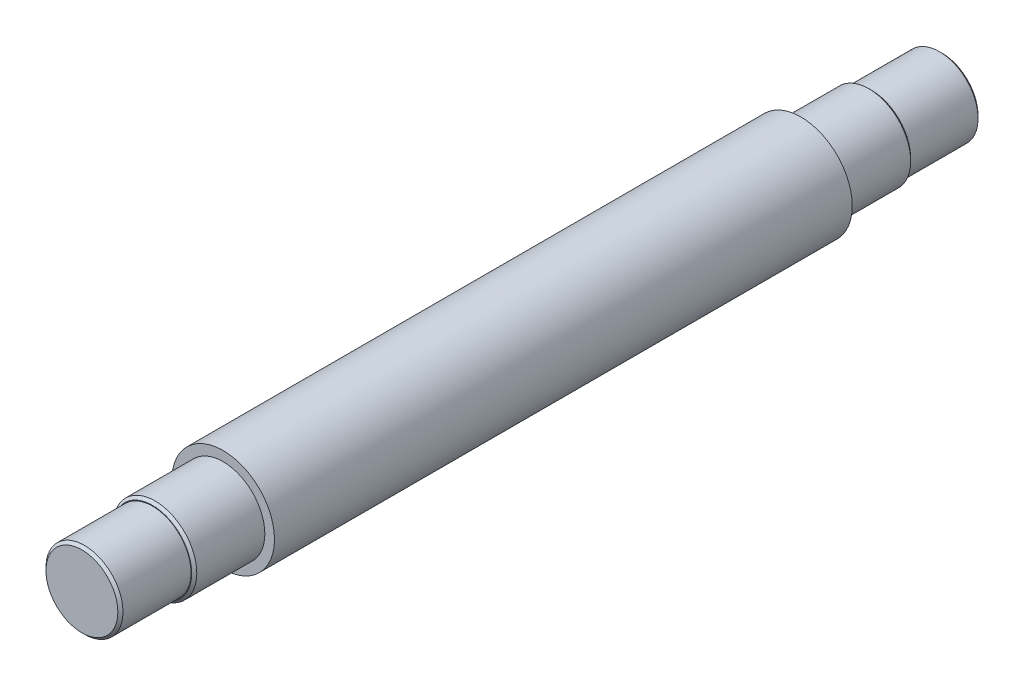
from build123d import *

# Parameters (mm, degrees)
SKETCH_1_R      = 40
EXTRUDE_1_DEPTH = 450
SKETCH_2_R      = 32.5
EXTRUDE_2_DEPTH = 55
EXTRUDE_START   = 55
SKETCH_3_R      = 32.5
EXTRUDE_3_DEPTH = 55
SKETCH_4_R      = 30
EXTRUDE_4_DEPTH = 55
SKETCH_5_R      = 30
EXTRUDE_5_DEPTH = 55
CHAMFER_1_SIZE  = 2
CHAMFER_2_SIZE  = 2


with BuildPart() as part:
    # Sketch 1 → Extrude 1 (new body)
    with BuildSketch(Plane.XY):
        Circle(SKETCH_1_R)
    extrude(amount=EXTRUDE_1_DEPTH)

    # Sketch 2 → Extrude 2 (add)
    with BuildSketch(Plane.XY.offset(450)):
        Circle(SKETCH_2_R)
    extrude(amount=EXTRUDE_2_DEPTH)

    # Sketch 3 → Extrude 3 (add)
    with BuildSketch(Plane(origin=(0, 0, 0), x_dir=(-1, 0, 0), z_dir=(0, 0, -1)).offset(EXTRUDE_START)):
        with Locations(Location((0, 0, 0), (0, 0, 180))):
            Circle(SKETCH_3_R)
    extrude(amount=-EXTRUDE_3_DEPTH)

    # Sketch 4 → Extrude 4 (add)
    with BuildSketch(Plane(origin=(0, 0, -55), x_dir=(-1, 0, 0), z_dir=(0, 0, -1))):
        Circle(SKETCH_4_R)
    extrude(amount=EXTRUDE_4_DEPTH)

    # Sketch 5 → Extrude 5 (add)
    with BuildSketch(Plane.XY.offset(505).offset(EXTRUDE_START)):
        with Locations(Location((0, 0, 0), (0, 0, 180))):
            Circle(SKETCH_5_R)
    extrude(amount=-EXTRUDE_5_DEPTH)

    # Chamfer 1
    chamfer_1_edges = [part.edges().sort_by_distance(p)[0] for p in [
        (-32.5, 0, -55),
    ]]
    chamfer(chamfer_1_edges, length=CHAMFER_1_SIZE)

    # Chamfer 2
    chamfer_2_edges = [part.edges().sort_by_distance(p)[0] for p in [
        (30, 0, -110),
        (30, 0, 560),
        (-32.5, 0, 505),
    ]]
    chamfer(chamfer_2_edges, length=CHAMFER_2_SIZE)


solid = part.part
